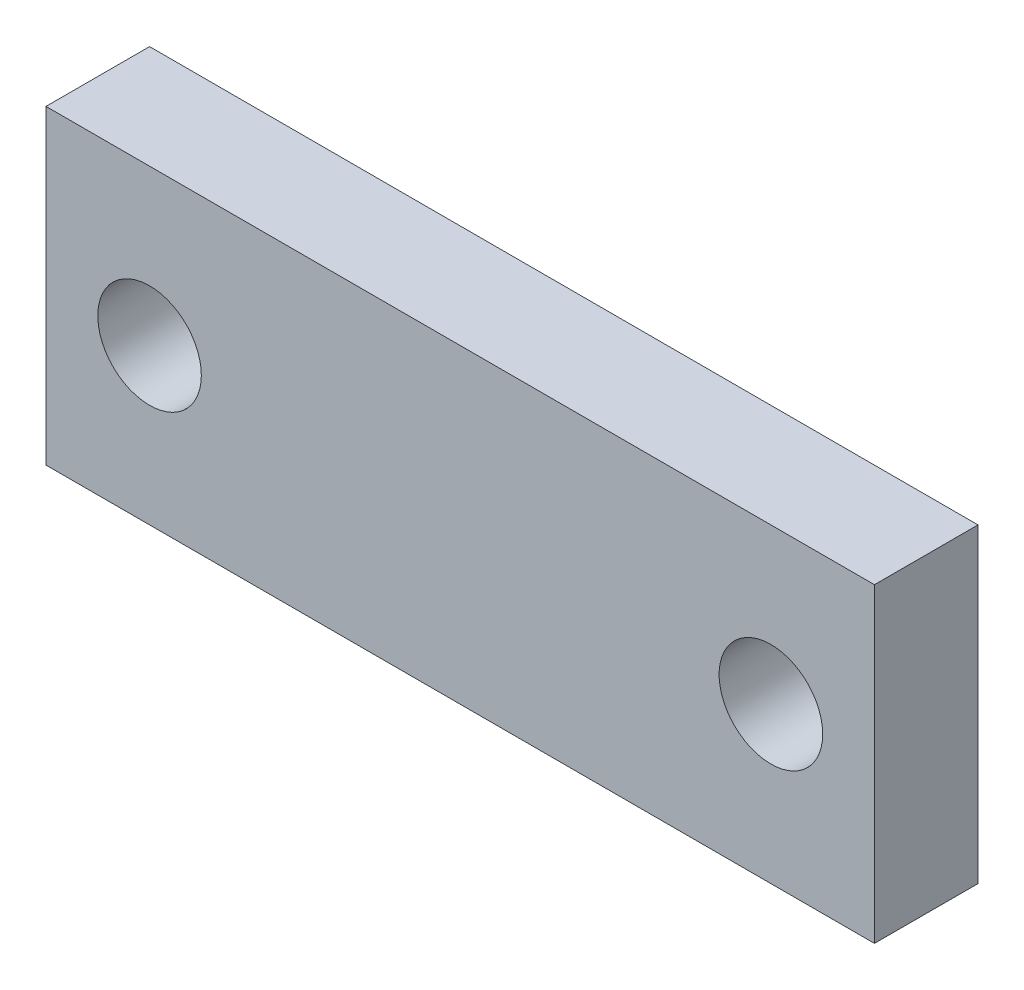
ISO-10303-21;
HEADER;
FILE_DESCRIPTION(('STEP AP214'),'2;1');
FILE_NAME('part.step','',(''),(''),'','','');
FILE_SCHEMA(('AUTOMOTIVE_DESIGN { 1 0 10303 214 1 1 1 1 }'));
ENDSEC;
DATA;
#1=APPLICATION_CONTEXT('core data for automotive mechanical design processes');
#2=APPLICATION_PROTOCOL_DEFINITION('international standard','automotive_design',2000,#1);
#3=PRODUCT_CONTEXT('',#1,'mechanical');
#4=PRODUCT('Part','Part','',(#3));
#5=PRODUCT_RELATED_PRODUCT_CATEGORY('part','',(#4));
#6=PRODUCT_DEFINITION_FORMATION('','',#4);
#7=PRODUCT_DEFINITION_CONTEXT('part definition',#1,'design');
#8=PRODUCT_DEFINITION('design','',#6,#7);
#9=PRODUCT_DEFINITION_SHAPE('','',#8);
#10=(LENGTH_UNIT() NAMED_UNIT(*) SI_UNIT(.MILLI.,.METRE.));
#11=(NAMED_UNIT(*) PLANE_ANGLE_UNIT() SI_UNIT($,.RADIAN.));
#12=(NAMED_UNIT(*) SI_UNIT($,.STERADIAN.) SOLID_ANGLE_UNIT());
#13=UNCERTAINTY_MEASURE_WITH_UNIT(LENGTH_MEASURE(1.E-05),#10,'distance_accuracy_value','');
#14=(GEOMETRIC_REPRESENTATION_CONTEXT(3) GLOBAL_UNCERTAINTY_ASSIGNED_CONTEXT((#13)) GLOBAL_UNIT_ASSIGNED_CONTEXT((#10,
#11,#12)) REPRESENTATION_CONTEXT('',''));
#15=CARTESIAN_POINT('',(0.,0.,0.));
#16=DIRECTION('',(0.,0.,1.));
#17=DIRECTION('',(1.,0.,0.));
#18=AXIS2_PLACEMENT_3D('',#15,#16,#17);
#19=CARTESIAN_POINT('',(-100.,0.,10.));
#20=DIRECTION('',(0.,0.,1.));
#21=DIRECTION('',(1.,0.,0.));
#22=AXIS2_PLACEMENT_3D('',#19,#20,#21);
#23=PLANE('',#22);
#24=CARTESIAN_POINT('',(-90.,15.,10.));
#25=DIRECTION('',(0.,0.,1.));
#26=DIRECTION('',(1.,0.,0.));
#27=AXIS2_PLACEMENT_3D('',#24,#25,#26);
#28=CIRCLE('',#27,5.);
#29=CARTESIAN_POINT('',(-85.,15.,10.));
#30=VERTEX_POINT('',#29);
#31=EDGE_CURVE('E98',#30,#30,#28,.T.);
#32=ORIENTED_EDGE('',*,*,#31,.F.);
#33=EDGE_LOOP('',(#32));
#34=FACE_BOUND('',#33,.T.);
#35=DIRECTION('',(0.,-1.,0.));
#36=VECTOR('',#35,1.);
#37=CARTESIAN_POINT('',(-100.,30.,10.));
#38=LINE('',#37,#36);
#39=CARTESIAN_POINT('',(-100.,30.,10.));
#40=VERTEX_POINT('',#39);
#41=CARTESIAN_POINT('',(-100.,0.,10.));
#42=VERTEX_POINT('',#41);
#43=EDGE_CURVE('E83',#40,#42,#38,.T.);
#44=ORIENTED_EDGE('',*,*,#43,.T.);
#45=DIRECTION('',(1.,0.,0.));
#46=VECTOR('',#45,1.);
#47=CARTESIAN_POINT('',(-100.,0.,10.));
#48=LINE('',#47,#46);
#49=CARTESIAN_POINT('',(-20.,0.,10.));
#50=VERTEX_POINT('',#49);
#51=EDGE_CURVE('E78',#42,#50,#48,.T.);
#52=ORIENTED_EDGE('',*,*,#51,.T.);
#53=DIRECTION('',(0.,1.,0.));
#54=VECTOR('',#53,1.);
#55=CARTESIAN_POINT('',(-20.,30.,10.));
#56=LINE('',#55,#54);
#57=CARTESIAN_POINT('',(-20.,30.,10.));
#58=VERTEX_POINT('',#57);
#59=EDGE_CURVE('E81',#50,#58,#56,.T.);
#60=ORIENTED_EDGE('',*,*,#59,.T.);
#61=DIRECTION('',(-1.,0.,0.));
#62=VECTOR('',#61,1.);
#63=CARTESIAN_POINT('',(-100.,30.,10.));
#64=LINE('',#63,#62);
#65=EDGE_CURVE('E48',#58,#40,#64,.T.);
#66=ORIENTED_EDGE('',*,*,#65,.T.);
#67=EDGE_LOOP('',(#44,#52,#60,#66));
#68=FACE_BOUND('',#67,.T.);
#69=CARTESIAN_POINT('',(-30.,15.,10.));
#70=DIRECTION('',(0.,0.,1.));
#71=DIRECTION('',(1.,0.,0.));
#72=AXIS2_PLACEMENT_3D('',#69,#70,#71);
#73=CIRCLE('',#72,5.);
#74=CARTESIAN_POINT('',(-25.,15.,10.));
#75=VERTEX_POINT('',#74);
#76=EDGE_CURVE('E113',#75,#75,#73,.T.);
#77=ORIENTED_EDGE('',*,*,#76,.F.);
#78=EDGE_LOOP('',(#77));
#79=FACE_BOUND('',#78,.T.);
#80=ADVANCED_FACE('F31',(#34,#68,#79),#23,.T.);
#81=CARTESIAN_POINT('',(-100.,0.,0.));
#82=DIRECTION('',(0.,0.,1.));
#83=DIRECTION('',(1.,0.,0.));
#84=AXIS2_PLACEMENT_3D('',#81,#82,#83);
#85=PLANE('',#84);
#86=CARTESIAN_POINT('',(-90.,15.,0.));
#87=DIRECTION('',(0.,0.,1.));
#88=DIRECTION('',(1.,0.,0.));
#89=AXIS2_PLACEMENT_3D('',#86,#87,#88);
#90=CIRCLE('',#89,5.);
#91=CARTESIAN_POINT('',(-85.,15.,0.));
#92=VERTEX_POINT('',#91);
#93=EDGE_CURVE('E110',#92,#92,#90,.T.);
#94=ORIENTED_EDGE('',*,*,#93,.T.);
#95=EDGE_LOOP('',(#94));
#96=FACE_BOUND('',#95,.T.);
#97=DIRECTION('',(0.,-1.,0.));
#98=VECTOR('',#97,1.);
#99=CARTESIAN_POINT('',(-100.,30.,0.));
#100=LINE('',#99,#98);
#101=CARTESIAN_POINT('',(-100.,30.,0.));
#102=VERTEX_POINT('',#101);
#103=CARTESIAN_POINT('',(-100.,0.,0.));
#104=VERTEX_POINT('',#103);
#105=EDGE_CURVE('E95',#102,#104,#100,.T.);
#106=ORIENTED_EDGE('',*,*,#105,.F.);
#107=DIRECTION('',(-1.,0.,0.));
#108=VECTOR('',#107,1.);
#109=CARTESIAN_POINT('',(-100.,30.,0.));
#110=LINE('',#109,#108);
#111=CARTESIAN_POINT('',(-20.,30.,0.));
#112=VERTEX_POINT('',#111);
#113=EDGE_CURVE('E71',#112,#102,#110,.T.);
#114=ORIENTED_EDGE('',*,*,#113,.F.);
#115=DIRECTION('',(0.,1.,0.));
#116=VECTOR('',#115,1.);
#117=CARTESIAN_POINT('',(-20.,30.,0.));
#118=LINE('',#117,#116);
#119=CARTESIAN_POINT('',(-20.,0.,0.));
#120=VERTEX_POINT('',#119);
#121=EDGE_CURVE('E65',#120,#112,#118,.T.);
#122=ORIENTED_EDGE('',*,*,#121,.F.);
#123=DIRECTION('',(1.,0.,0.));
#124=VECTOR('',#123,1.);
#125=CARTESIAN_POINT('',(-100.,0.,0.));
#126=LINE('',#125,#124);
#127=EDGE_CURVE('E87',#104,#120,#126,.T.);
#128=ORIENTED_EDGE('',*,*,#127,.F.);
#129=EDGE_LOOP('',(#106,#114,#122,#128));
#130=FACE_BOUND('',#129,.T.);
#131=CARTESIAN_POINT('',(-30.,15.,0.));
#132=DIRECTION('',(0.,0.,1.));
#133=DIRECTION('',(1.,0.,0.));
#134=AXIS2_PLACEMENT_3D('',#131,#132,#133);
#135=CIRCLE('',#134,5.);
#136=CARTESIAN_POINT('',(-25.,15.,0.));
#137=VERTEX_POINT('',#136);
#138=EDGE_CURVE('E116',#137,#137,#135,.T.);
#139=ORIENTED_EDGE('',*,*,#138,.T.);
#140=EDGE_LOOP('',(#139));
#141=FACE_BOUND('',#140,.T.);
#142=ADVANCED_FACE('F106',(#96,#130,#141),#85,.F.);
#143=CARTESIAN_POINT('',(-100.,30.,10.));
#144=DIRECTION('',(1.,0.,0.));
#145=DIRECTION('',(0.,0.,-1.));
#146=AXIS2_PLACEMENT_3D('',#143,#144,#145);
#147=PLANE('',#146);
#148=ORIENTED_EDGE('',*,*,#105,.T.);
#149=DIRECTION('',(0.,0.,-1.));
#150=VECTOR('',#149,1.);
#151=CARTESIAN_POINT('',(-100.,0.,10.));
#152=LINE('',#151,#150);
#153=EDGE_CURVE('E11',#42,#104,#152,.T.);
#154=ORIENTED_EDGE('',*,*,#153,.F.);
#155=ORIENTED_EDGE('',*,*,#43,.F.);
#156=DIRECTION('',(0.,0.,-1.));
#157=VECTOR('',#156,1.);
#158=CARTESIAN_POINT('',(-100.,30.,10.));
#159=LINE('',#158,#157);
#160=EDGE_CURVE('E91',#40,#102,#159,.T.);
#161=ORIENTED_EDGE('',*,*,#160,.T.);
#162=EDGE_LOOP('',(#148,#154,#155,#161));
#163=FACE_BOUND('',#162,.T.);
#164=ADVANCED_FACE('F33',(#163),#147,.F.);
#165=CARTESIAN_POINT('',(-100.,0.,10.));
#166=DIRECTION('',(0.,1.,0.));
#167=DIRECTION('',(0.,0.,1.));
#168=AXIS2_PLACEMENT_3D('',#165,#166,#167);
#169=PLANE('',#168);
#170=ORIENTED_EDGE('',*,*,#127,.T.);
#171=DIRECTION('',(0.,0.,-1.));
#172=VECTOR('',#171,1.);
#173=CARTESIAN_POINT('',(-20.,0.,10.));
#174=LINE('',#173,#172);
#175=EDGE_CURVE('E40',#50,#120,#174,.T.);
#176=ORIENTED_EDGE('',*,*,#175,.F.);
#177=ORIENTED_EDGE('',*,*,#51,.F.);
#178=ORIENTED_EDGE('',*,*,#153,.T.);
#179=EDGE_LOOP('',(#170,#176,#177,#178));
#180=FACE_BOUND('',#179,.T.);
#181=ADVANCED_FACE('F86',(#180),#169,.F.);
#182=CARTESIAN_POINT('',(-20.,30.,10.));
#183=DIRECTION('',(-1.,0.,0.));
#184=DIRECTION('',(0.,0.,1.));
#185=AXIS2_PLACEMENT_3D('',#182,#183,#184);
#186=PLANE('',#185);
#187=ORIENTED_EDGE('',*,*,#121,.T.);
#188=DIRECTION('',(0.,0.,-1.));
#189=VECTOR('',#188,1.);
#190=CARTESIAN_POINT('',(-20.,30.,10.));
#191=LINE('',#190,#189);
#192=EDGE_CURVE('E88',#58,#112,#191,.T.);
#193=ORIENTED_EDGE('',*,*,#192,.F.);
#194=ORIENTED_EDGE('',*,*,#59,.F.);
#195=ORIENTED_EDGE('',*,*,#175,.T.);
#196=EDGE_LOOP('',(#187,#193,#194,#195));
#197=FACE_BOUND('',#196,.T.);
#198=ADVANCED_FACE('F89',(#197),#186,.F.);
#199=CARTESIAN_POINT('',(-100.,30.,10.));
#200=DIRECTION('',(0.,-1.,0.));
#201=DIRECTION('',(0.,0.,-1.));
#202=AXIS2_PLACEMENT_3D('',#199,#200,#201);
#203=PLANE('',#202);
#204=ORIENTED_EDGE('',*,*,#113,.T.);
#205=ORIENTED_EDGE('',*,*,#160,.F.);
#206=ORIENTED_EDGE('',*,*,#65,.F.);
#207=ORIENTED_EDGE('',*,*,#192,.T.);
#208=EDGE_LOOP('',(#204,#205,#206,#207));
#209=FACE_BOUND('',#208,.T.);
#210=ADVANCED_FACE('F103',(#209),#203,.F.);
#211=CARTESIAN_POINT('',(-90.,15.,10.));
#212=DIRECTION('',(0.,0.,-1.));
#213=DIRECTION('',(-1.,0.,0.));
#214=AXIS2_PLACEMENT_3D('',#211,#212,#213);
#215=CYLINDRICAL_SURFACE('',#214,5.);
#216=ORIENTED_EDGE('',*,*,#31,.T.);
#217=EDGE_LOOP('',(#216));
#218=FACE_BOUND('',#217,.T.);
#219=ORIENTED_EDGE('',*,*,#93,.F.);
#220=EDGE_LOOP('',(#219));
#221=FACE_BOUND('',#220,.T.);
#222=ADVANCED_FACE('F134',(#218,#221),#215,.F.);
#223=CARTESIAN_POINT('',(-30.,15.,10.));
#224=DIRECTION('',(0.,0.,-1.));
#225=DIRECTION('',(-1.,0.,0.));
#226=AXIS2_PLACEMENT_3D('',#223,#224,#225);
#227=CYLINDRICAL_SURFACE('',#226,5.);
#228=ORIENTED_EDGE('',*,*,#76,.T.);
#229=EDGE_LOOP('',(#228));
#230=FACE_BOUND('',#229,.T.);
#231=ORIENTED_EDGE('',*,*,#138,.F.);
#232=EDGE_LOOP('',(#231));
#233=FACE_BOUND('',#232,.T.);
#234=ADVANCED_FACE('F122',(#230,#233),#227,.F.);
#235=CLOSED_SHELL('',(#80,#142,#164,#181,#198,#210,#222,#234));
#236=MANIFOLD_SOLID_BREP('B2',#235);
#237=ADVANCED_BREP_SHAPE_REPRESENTATION('',(#18,#236),#14);
#238=SHAPE_DEFINITION_REPRESENTATION(#9,#237);
ENDSEC;
END-ISO-10303-21;
